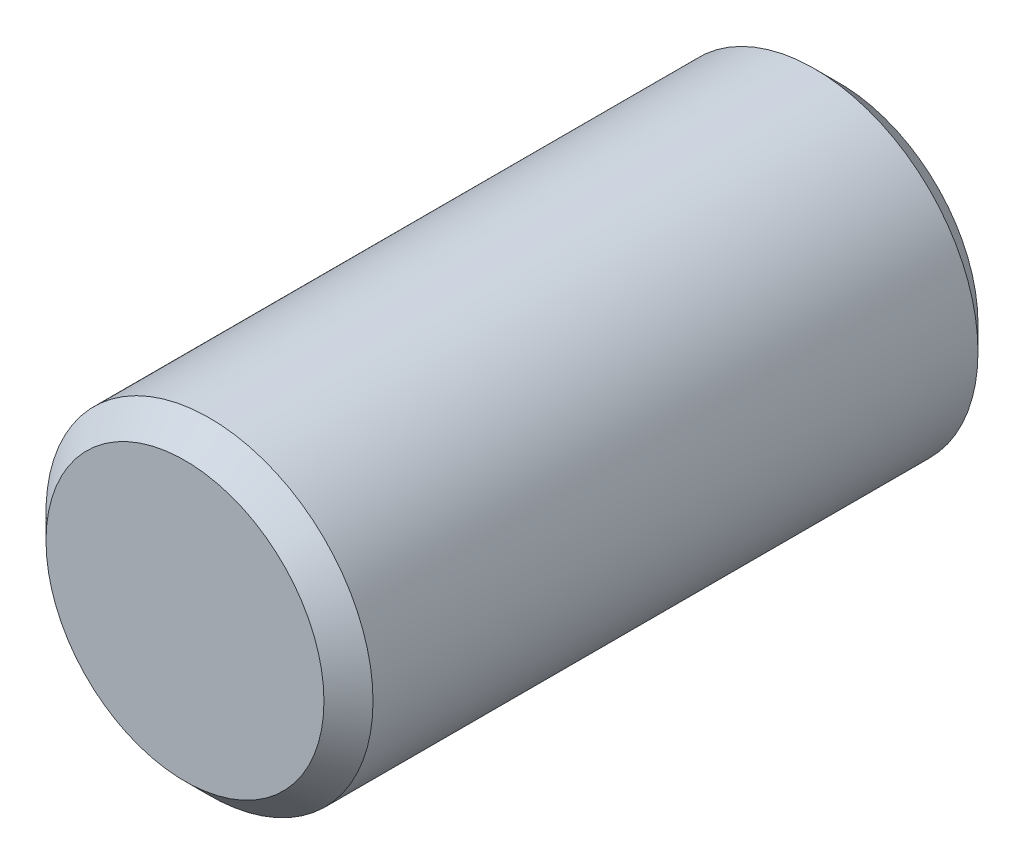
ISO-10303-21;
HEADER;
FILE_DESCRIPTION(('STEP AP214'),'2;1');
FILE_NAME('part.step','',(''),(''),'','','');
FILE_SCHEMA(('AUTOMOTIVE_DESIGN { 1 0 10303 214 1 1 1 1 }'));
ENDSEC;
DATA;
#1=APPLICATION_CONTEXT('core data for automotive mechanical design processes');
#2=APPLICATION_PROTOCOL_DEFINITION('international standard','automotive_design',2000,#1);
#3=PRODUCT_CONTEXT('',#1,'mechanical');
#4=PRODUCT('Part','Part','',(#3));
#5=PRODUCT_RELATED_PRODUCT_CATEGORY('part','',(#4));
#6=PRODUCT_DEFINITION_FORMATION('','',#4);
#7=PRODUCT_DEFINITION_CONTEXT('part definition',#1,'design');
#8=PRODUCT_DEFINITION('design','',#6,#7);
#9=PRODUCT_DEFINITION_SHAPE('','',#8);
#10=(LENGTH_UNIT() NAMED_UNIT(*) SI_UNIT(.MILLI.,.METRE.));
#11=(NAMED_UNIT(*) PLANE_ANGLE_UNIT() SI_UNIT($,.RADIAN.));
#12=(NAMED_UNIT(*) SI_UNIT($,.STERADIAN.) SOLID_ANGLE_UNIT());
#13=UNCERTAINTY_MEASURE_WITH_UNIT(LENGTH_MEASURE(1.E-05),#10,'distance_accuracy_value','');
#14=(GEOMETRIC_REPRESENTATION_CONTEXT(3) GLOBAL_UNCERTAINTY_ASSIGNED_CONTEXT((#13)) GLOBAL_UNIT_ASSIGNED_CONTEXT((#10,
#11,#12)) REPRESENTATION_CONTEXT('',''));
#15=CARTESIAN_POINT('',(0.,0.,0.));
#16=DIRECTION('',(0.,0.,1.));
#17=DIRECTION('',(1.,0.,0.));
#18=AXIS2_PLACEMENT_3D('',#15,#16,#17);
#19=CARTESIAN_POINT('',(0.,0.,-8.));
#20=DIRECTION('',(0.,0.,1.));
#21=DIRECTION('',(1.,0.,0.));
#22=AXIS2_PLACEMENT_3D('',#19,#20,#21);
#23=CYLINDRICAL_SURFACE('',#22,2.);
#24=CARTESIAN_POINT('',(0.,0.,-7.7));
#25=DIRECTION('',(0.,0.,1.));
#26=DIRECTION('',(1.,0.,0.));
#27=AXIS2_PLACEMENT_3D('',#24,#25,#26);
#28=CIRCLE('',#27,2.);
#29=CARTESIAN_POINT('',(2.,0.,-7.7));
#30=VERTEX_POINT('',#29);
#31=EDGE_CURVE('E147',#30,#30,#28,.T.);
#32=ORIENTED_EDGE('',*,*,#31,.T.);
#33=EDGE_LOOP('',(#32));
#34=FACE_BOUND('',#33,.T.);
#35=CARTESIAN_POINT('',(0.,0.,-0.299999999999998));
#36=DIRECTION('',(0.,0.,1.));
#37=DIRECTION('',(1.,0.,0.));
#38=AXIS2_PLACEMENT_3D('',#35,#36,#37);
#39=CIRCLE('',#38,2.);
#40=CARTESIAN_POINT('',(2.,0.,-0.299999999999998));
#41=VERTEX_POINT('',#40);
#42=EDGE_CURVE('E139',#41,#41,#39,.F.);
#43=ORIENTED_EDGE('',*,*,#42,.T.);
#44=EDGE_LOOP('',(#43));
#45=FACE_BOUND('',#44,.T.);
#46=ADVANCED_FACE('F37',(#34,#45),#23,.T.);
#47=CARTESIAN_POINT('',(0.,0.,-8.));
#48=DIRECTION('',(0.,0.,1.));
#49=DIRECTION('',(1.,0.,0.));
#50=AXIS2_PLACEMENT_3D('',#47,#48,#49);
#51=PLANE('',#50);
#52=CARTESIAN_POINT('',(0.,0.,-8.));
#53=DIRECTION('',(0.,0.,1.));
#54=DIRECTION('',(1.,0.,0.));
#55=AXIS2_PLACEMENT_3D('',#52,#53,#54);
#56=CIRCLE('',#55,1.7);
#57=CARTESIAN_POINT('',(1.7,0.,-8.));
#58=VERTEX_POINT('',#57);
#59=EDGE_CURVE('E45',#58,#58,#56,.F.);
#60=ORIENTED_EDGE('',*,*,#59,.T.);
#61=EDGE_LOOP('',(#60));
#62=FACE_BOUND('',#61,.T.);
#63=DIRECTION('',(0.5,0.866025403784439,0.));
#64=VECTOR('',#63,1.);
#65=CARTESIAN_POINT('',(-1.15470053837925,0.,-8.));
#66=LINE('',#65,#64);
#67=CARTESIAN_POINT('',(-1.15470053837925,0.,-8.));
#68=VERTEX_POINT('',#67);
#69=CARTESIAN_POINT('',(-0.577350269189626,1.,-8.));
#70=VERTEX_POINT('',#69);
#71=EDGE_CURVE('E126',#68,#70,#66,.T.);
#72=ORIENTED_EDGE('',*,*,#71,.F.);
#73=DIRECTION('',(-0.5,0.866025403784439,0.));
#74=VECTOR('',#73,1.);
#75=CARTESIAN_POINT('',(-0.577350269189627,-1.,-8.));
#76=LINE('',#75,#74);
#77=CARTESIAN_POINT('',(-0.577350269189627,-1.,-8.));
#78=VERTEX_POINT('',#77);
#79=EDGE_CURVE('E52',#78,#68,#76,.T.);
#80=ORIENTED_EDGE('',*,*,#79,.F.);
#81=DIRECTION('',(-1.,0.,0.));
#82=VECTOR('',#81,1.);
#83=CARTESIAN_POINT('',(0.577350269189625,-1.,-8.));
#84=LINE('',#83,#82);
#85=CARTESIAN_POINT('',(0.577350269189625,-1.,-8.));
#86=VERTEX_POINT('',#85);
#87=EDGE_CURVE('E135',#86,#78,#84,.T.);
#88=ORIENTED_EDGE('',*,*,#87,.F.);
#89=DIRECTION('',(-0.5,-0.866025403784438,0.));
#90=VECTOR('',#89,1.);
#91=CARTESIAN_POINT('',(1.15470053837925,0.,-8.));
#92=LINE('',#91,#90);
#93=CARTESIAN_POINT('',(1.15470053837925,0.,-8.));
#94=VERTEX_POINT('',#93);
#95=EDGE_CURVE('E133',#94,#86,#92,.T.);
#96=ORIENTED_EDGE('',*,*,#95,.F.);
#97=DIRECTION('',(0.5,-0.866025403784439,0.));
#98=VECTOR('',#97,1.);
#99=CARTESIAN_POINT('',(0.577350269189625,1.,-8.));
#100=LINE('',#99,#98);
#101=CARTESIAN_POINT('',(0.577350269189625,1.,-8.));
#102=VERTEX_POINT('',#101);
#103=EDGE_CURVE('E100',#102,#94,#100,.T.);
#104=ORIENTED_EDGE('',*,*,#103,.F.);
#105=DIRECTION('',(1.,0.,0.));
#106=VECTOR('',#105,1.);
#107=CARTESIAN_POINT('',(-0.577350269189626,1.,-8.));
#108=LINE('',#107,#106);
#109=EDGE_CURVE('E129',#70,#102,#108,.T.);
#110=ORIENTED_EDGE('',*,*,#109,.F.);
#111=EDGE_LOOP('',(#72,#80,#88,#96,#104,#110));
#112=FACE_BOUND('',#111,.T.);
#113=ADVANCED_FACE('F152',(#62,#112),#51,.F.);
#114=CARTESIAN_POINT('',(0.,0.,0.));
#115=DIRECTION('',(0.,0.,1.));
#116=DIRECTION('',(1.,0.,0.));
#117=AXIS2_PLACEMENT_3D('',#114,#115,#116);
#118=PLANE('',#117);
#119=CARTESIAN_POINT('',(0.,0.,0.));
#120=DIRECTION('',(0.,0.,1.));
#121=DIRECTION('',(1.,0.,0.));
#122=AXIS2_PLACEMENT_3D('',#119,#120,#121);
#123=CIRCLE('',#122,1.7);
#124=CARTESIAN_POINT('',(1.7,0.,0.));
#125=VERTEX_POINT('',#124);
#126=EDGE_CURVE('E11',#125,#125,#123,.T.);
#127=ORIENTED_EDGE('',*,*,#126,.T.);
#128=EDGE_LOOP('',(#127));
#129=FACE_BOUND('',#128,.T.);
#130=ADVANCED_FACE('F169',(#129),#118,.T.);
#131=CARTESIAN_POINT('',(-0.577350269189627,-1.,-6.));
#132=DIRECTION('',(-0.866025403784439,-0.5,0.));
#133=DIRECTION('',(0.5,-0.866025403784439,0.));
#134=AXIS2_PLACEMENT_3D('',#131,#132,#133);
#135=PLANE('',#134);
#136=ORIENTED_EDGE('',*,*,#79,.T.);
#137=DIRECTION('',(0.,0.,-1.));
#138=VECTOR('',#137,1.);
#139=CARTESIAN_POINT('',(-1.15470053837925,0.,-6.));
#140=LINE('',#139,#138);
#141=CARTESIAN_POINT('',(-1.15470053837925,0.,-6.));
#142=VERTEX_POINT('',#141);
#143=EDGE_CURVE('E82',#142,#68,#140,.T.);
#144=ORIENTED_EDGE('',*,*,#143,.F.);
#145=DIRECTION('',(-0.5,0.866025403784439,0.));
#146=VECTOR('',#145,1.);
#147=CARTESIAN_POINT('',(-0.577350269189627,-1.,-6.));
#148=LINE('',#147,#146);
#149=CARTESIAN_POINT('',(-0.577350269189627,-1.,-6.));
#150=VERTEX_POINT('',#149);
#151=EDGE_CURVE('E137',#150,#142,#148,.T.);
#152=ORIENTED_EDGE('',*,*,#151,.F.);
#153=DIRECTION('',(0.,0.,-1.));
#154=VECTOR('',#153,1.);
#155=CARTESIAN_POINT('',(-0.577350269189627,-1.,-6.));
#156=LINE('',#155,#154);
#157=EDGE_CURVE('E60',#150,#78,#156,.T.);
#158=ORIENTED_EDGE('',*,*,#157,.T.);
#159=EDGE_LOOP('',(#136,#144,#152,#158));
#160=FACE_BOUND('',#159,.T.);
#161=ADVANCED_FACE('F171',(#160),#135,.F.);
#162=CARTESIAN_POINT('',(0.577350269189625,-1.,-6.));
#163=DIRECTION('',(0.,-1.,0.));
#164=DIRECTION('',(0.,0.,-1.));
#165=AXIS2_PLACEMENT_3D('',#162,#163,#164);
#166=PLANE('',#165);
#167=ORIENTED_EDGE('',*,*,#87,.T.);
#168=ORIENTED_EDGE('',*,*,#157,.F.);
#169=DIRECTION('',(-1.,0.,0.));
#170=VECTOR('',#169,1.);
#171=CARTESIAN_POINT('',(0.577350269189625,-1.,-6.));
#172=LINE('',#171,#170);
#173=CARTESIAN_POINT('',(0.577350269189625,-1.,-6.));
#174=VERTEX_POINT('',#173);
#175=EDGE_CURVE('E112',#174,#150,#172,.T.);
#176=ORIENTED_EDGE('',*,*,#175,.F.);
#177=DIRECTION('',(0.,0.,-1.));
#178=VECTOR('',#177,1.);
#179=CARTESIAN_POINT('',(0.577350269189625,-1.,-6.));
#180=LINE('',#179,#178);
#181=EDGE_CURVE('E104',#174,#86,#180,.T.);
#182=ORIENTED_EDGE('',*,*,#181,.T.);
#183=EDGE_LOOP('',(#167,#168,#176,#182));
#184=FACE_BOUND('',#183,.T.);
#185=ADVANCED_FACE('F177',(#184),#166,.F.);
#186=CARTESIAN_POINT('',(1.15470053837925,0.,-6.));
#187=DIRECTION('',(0.866025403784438,-0.5,0.));
#188=DIRECTION('',(0.5,0.866025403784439,0.));
#189=AXIS2_PLACEMENT_3D('',#186,#187,#188);
#190=PLANE('',#189);
#191=ORIENTED_EDGE('',*,*,#95,.T.);
#192=ORIENTED_EDGE('',*,*,#181,.F.);
#193=DIRECTION('',(-0.5,-0.866025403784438,0.));
#194=VECTOR('',#193,1.);
#195=CARTESIAN_POINT('',(1.15470053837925,0.,-6.));
#196=LINE('',#195,#194);
#197=CARTESIAN_POINT('',(1.15470053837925,0.,-6.));
#198=VERTEX_POINT('',#197);
#199=EDGE_CURVE('E108',#198,#174,#196,.T.);
#200=ORIENTED_EDGE('',*,*,#199,.F.);
#201=DIRECTION('',(0.,0.,-1.));
#202=VECTOR('',#201,1.);
#203=CARTESIAN_POINT('',(1.15470053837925,0.,-6.));
#204=LINE('',#203,#202);
#205=EDGE_CURVE('E93',#198,#94,#204,.T.);
#206=ORIENTED_EDGE('',*,*,#205,.T.);
#207=EDGE_LOOP('',(#191,#192,#200,#206));
#208=FACE_BOUND('',#207,.T.);
#209=ADVANCED_FACE('F109',(#208),#190,.F.);
#210=CARTESIAN_POINT('',(0.577350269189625,1.,-6.));
#211=DIRECTION('',(0.866025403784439,0.5,0.));
#212=DIRECTION('',(-0.5,0.866025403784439,0.));
#213=AXIS2_PLACEMENT_3D('',#210,#211,#212);
#214=PLANE('',#213);
#215=ORIENTED_EDGE('',*,*,#103,.T.);
#216=ORIENTED_EDGE('',*,*,#205,.F.);
#217=DIRECTION('',(0.5,-0.866025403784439,0.));
#218=VECTOR('',#217,1.);
#219=CARTESIAN_POINT('',(0.577350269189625,1.,-6.));
#220=LINE('',#219,#218);
#221=CARTESIAN_POINT('',(0.577350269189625,1.,-6.));
#222=VERTEX_POINT('',#221);
#223=EDGE_CURVE('E97',#222,#198,#220,.T.);
#224=ORIENTED_EDGE('',*,*,#223,.F.);
#225=DIRECTION('',(0.,0.,-1.));
#226=VECTOR('',#225,1.);
#227=CARTESIAN_POINT('',(0.577350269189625,1.,-6.));
#228=LINE('',#227,#226);
#229=EDGE_CURVE('E105',#222,#102,#228,.T.);
#230=ORIENTED_EDGE('',*,*,#229,.T.);
#231=EDGE_LOOP('',(#215,#216,#224,#230));
#232=FACE_BOUND('',#231,.T.);
#233=ADVANCED_FACE('F95',(#232),#214,.F.);
#234=CARTESIAN_POINT('',(-0.577350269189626,1.,-6.));
#235=DIRECTION('',(0.,1.,0.));
#236=DIRECTION('',(0.,0.,1.));
#237=AXIS2_PLACEMENT_3D('',#234,#235,#236);
#238=PLANE('',#237);
#239=ORIENTED_EDGE('',*,*,#109,.T.);
#240=ORIENTED_EDGE('',*,*,#229,.F.);
#241=DIRECTION('',(1.,0.,0.));
#242=VECTOR('',#241,1.);
#243=CARTESIAN_POINT('',(-0.577350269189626,1.,-6.));
#244=LINE('',#243,#242);
#245=CARTESIAN_POINT('',(-0.577350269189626,1.,-6.));
#246=VERTEX_POINT('',#245);
#247=EDGE_CURVE('E118',#246,#222,#244,.T.);
#248=ORIENTED_EDGE('',*,*,#247,.F.);
#249=DIRECTION('',(0.,0.,-1.));
#250=VECTOR('',#249,1.);
#251=CARTESIAN_POINT('',(-0.577350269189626,1.,-6.));
#252=LINE('',#251,#250);
#253=EDGE_CURVE('E142',#246,#70,#252,.T.);
#254=ORIENTED_EDGE('',*,*,#253,.T.);
#255=EDGE_LOOP('',(#239,#240,#248,#254));
#256=FACE_BOUND('',#255,.T.);
#257=ADVANCED_FACE('F184',(#256),#238,.F.);
#258=CARTESIAN_POINT('',(-1.15470053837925,0.,-6.));
#259=DIRECTION('',(-0.866025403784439,0.5,0.));
#260=DIRECTION('',(-0.5,-0.866025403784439,0.));
#261=AXIS2_PLACEMENT_3D('',#258,#259,#260);
#262=PLANE('',#261);
#263=ORIENTED_EDGE('',*,*,#71,.T.);
#264=ORIENTED_EDGE('',*,*,#253,.F.);
#265=DIRECTION('',(0.5,0.866025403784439,0.));
#266=VECTOR('',#265,1.);
#267=CARTESIAN_POINT('',(-1.15470053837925,0.,-6.));
#268=LINE('',#267,#266);
#269=EDGE_CURVE('E120',#142,#246,#268,.T.);
#270=ORIENTED_EDGE('',*,*,#269,.F.);
#271=ORIENTED_EDGE('',*,*,#143,.T.);
#272=EDGE_LOOP('',(#263,#264,#270,#271));
#273=FACE_BOUND('',#272,.T.);
#274=ADVANCED_FACE('F181',(#273),#262,.F.);
#275=CARTESIAN_POINT('',(0.,-2.,-6.));
#276=DIRECTION('',(0.,0.,1.));
#277=DIRECTION('',(1.,0.,0.));
#278=AXIS2_PLACEMENT_3D('',#275,#276,#277);
#279=PLANE('',#278);
#280=ORIENTED_EDGE('',*,*,#151,.T.);
#281=ORIENTED_EDGE('',*,*,#269,.T.);
#282=ORIENTED_EDGE('',*,*,#247,.T.);
#283=ORIENTED_EDGE('',*,*,#223,.T.);
#284=ORIENTED_EDGE('',*,*,#199,.T.);
#285=ORIENTED_EDGE('',*,*,#175,.T.);
#286=EDGE_LOOP('',(#280,#281,#282,#283,#284,#285));
#287=FACE_BOUND('',#286,.T.);
#288=ADVANCED_FACE('F115',(#287),#279,.F.);
#289=CARTESIAN_POINT('',(0.,0.,-7.7));
#290=DIRECTION('',(0.,0.,1.));
#291=DIRECTION('',(1.,0.,0.));
#292=AXIS2_PLACEMENT_3D('',#289,#290,#291);
#293=CONICAL_SURFACE('',#292,2.,0.78539816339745);
#294=CARTESIAN_POINT('',(1.7,0.,-8.));
#295=CARTESIAN_POINT('',(1.703125,0.,-7.996875));
#296=CARTESIAN_POINT('',(1.70625,0.,-7.99375));
#297=CARTESIAN_POINT('',(1.7125,0.,-7.9875));
#298=CARTESIAN_POINT('',(1.715625,0.,-7.984375));
#299=CARTESIAN_POINT('',(1.721875,0.,-7.978125));
#300=CARTESIAN_POINT('',(1.725,0.,-7.975));
#301=CARTESIAN_POINT('',(1.73125,0.,-7.96875));
#302=CARTESIAN_POINT('',(1.734375,0.,-7.965625));
#303=CARTESIAN_POINT('',(1.740625,0.,-7.959375));
#304=CARTESIAN_POINT('',(1.74375,0.,-7.95625));
#305=CARTESIAN_POINT('',(1.75,0.,-7.95));
#306=CARTESIAN_POINT('',(1.753125,0.,-7.946875));
#307=CARTESIAN_POINT('',(1.759375,0.,-7.940625));
#308=CARTESIAN_POINT('',(1.7625,0.,-7.9375));
#309=CARTESIAN_POINT('',(1.76875,0.,-7.93125));
#310=CARTESIAN_POINT('',(1.771875,0.,-7.928125));
#311=CARTESIAN_POINT('',(1.778125,0.,-7.921875));
#312=CARTESIAN_POINT('',(1.78125,0.,-7.91875));
#313=CARTESIAN_POINT('',(1.7875,0.,-7.9125));
#314=CARTESIAN_POINT('',(1.790625,0.,-7.909375));
#315=CARTESIAN_POINT('',(1.796875,0.,-7.903125));
#316=CARTESIAN_POINT('',(1.8,0.,-7.9));
#317=CARTESIAN_POINT('',(1.80625,0.,-7.89375));
#318=CARTESIAN_POINT('',(1.809375,0.,-7.890625));
#319=CARTESIAN_POINT('',(1.815625,0.,-7.884375));
#320=CARTESIAN_POINT('',(1.81875,0.,-7.88125));
#321=CARTESIAN_POINT('',(1.825,0.,-7.875));
#322=CARTESIAN_POINT('',(1.828125,0.,-7.871875));
#323=CARTESIAN_POINT('',(1.834375,0.,-7.865625));
#324=CARTESIAN_POINT('',(1.8375,0.,-7.8625));
#325=CARTESIAN_POINT('',(1.84375,0.,-7.85625));
#326=CARTESIAN_POINT('',(1.846875,0.,-7.853125));
#327=CARTESIAN_POINT('',(1.853125,0.,-7.846875));
#328=CARTESIAN_POINT('',(1.85625,0.,-7.84375));
#329=CARTESIAN_POINT('',(1.8625,0.,-7.8375));
#330=CARTESIAN_POINT('',(1.865625,0.,-7.834375));
#331=CARTESIAN_POINT('',(1.871875,0.,-7.828125));
#332=CARTESIAN_POINT('',(1.875,0.,-7.825));
#333=CARTESIAN_POINT('',(1.88125,0.,-7.81875));
#334=CARTESIAN_POINT('',(1.884375,0.,-7.815625));
#335=CARTESIAN_POINT('',(1.890625,0.,-7.809375));
#336=CARTESIAN_POINT('',(1.89375,0.,-7.80625));
#337=CARTESIAN_POINT('',(1.9,0.,-7.8));
#338=CARTESIAN_POINT('',(1.903125,0.,-7.796875));
#339=CARTESIAN_POINT('',(1.909375,0.,-7.790625));
#340=CARTESIAN_POINT('',(1.9125,0.,-7.7875));
#341=CARTESIAN_POINT('',(1.91875,0.,-7.78125));
#342=CARTESIAN_POINT('',(1.921875,0.,-7.778125));
#343=CARTESIAN_POINT('',(1.928125,0.,-7.771875));
#344=CARTESIAN_POINT('',(1.93125,0.,-7.76875));
#345=CARTESIAN_POINT('',(1.9375,0.,-7.7625));
#346=CARTESIAN_POINT('',(1.940625,0.,-7.759375));
#347=CARTESIAN_POINT('',(1.946875,0.,-7.753125));
#348=CARTESIAN_POINT('',(1.95,0.,-7.75));
#349=CARTESIAN_POINT('',(1.95625,0.,-7.74375));
#350=CARTESIAN_POINT('',(1.959375,0.,-7.740625));
#351=CARTESIAN_POINT('',(1.965625,0.,-7.734375));
#352=CARTESIAN_POINT('',(1.96875,0.,-7.73125));
#353=CARTESIAN_POINT('',(1.975,0.,-7.725));
#354=CARTESIAN_POINT('',(1.978125,0.,-7.721875));
#355=CARTESIAN_POINT('',(1.984375,0.,-7.715625));
#356=CARTESIAN_POINT('',(1.9875,0.,-7.7125));
#357=CARTESIAN_POINT('',(1.99375,0.,-7.70625));
#358=CARTESIAN_POINT('',(1.996875,0.,-7.703125));
#359=CARTESIAN_POINT('',(2.,0.,-7.7));
#360=B_SPLINE_CURVE_WITH_KNOTS('',3,(#294,#295,#296,#297,#298,#299,#300,#301,#302,#303,#304,
#305,#306,#307,#308,#309,#310,#311,#312,#313,#314,#315,#316,#317,#318,#319,#320,#321,#322,#323,
#324,#325,#326,#327,#328,#329,#330,#331,#332,#333,#334,#335,#336,#337,#338,#339,#340,#341,#342,
#343,#344,#345,#346,#347,#348,#349,#350,#351,#352,#353,#354,#355,#356,#357,#358,#359),
.UNSPECIFIED.,.F.,.F.,(4,2,2,2,2,2,2,2,2,2,2,2,2,2,2,2,2,2,2,2,2,2,2,2,2,2,2,2,2,2,2,2,4),(0.,
0.0132582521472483,0.0265165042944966,0.0397747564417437,0.053033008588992,0.0662912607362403,
0.0795495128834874,0.0928077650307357,0.106066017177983,0.119324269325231,0.132582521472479,
0.145840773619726,0.159099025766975,0.172357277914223,0.18561553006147,0.198873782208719,
0.212132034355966,0.225390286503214,0.238648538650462,0.251906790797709,0.265165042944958,
0.278423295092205,0.291681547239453,0.304939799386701,0.318198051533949,0.331456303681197,
0.344714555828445,0.357972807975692,0.37123106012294,0.384489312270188,0.397747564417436,
0.411005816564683,0.424264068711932),.UNSPECIFIED.);
#361=EDGE_CURVE('BSEAM155',#58,#30,#360,.T.);
#362=ORIENTED_EDGE('',*,*,#59,.F.);
#363=ORIENTED_EDGE('',*,*,#31,.F.);
#364=ORIENTED_EDGE('',*,*,#361,.T.);
#365=ORIENTED_EDGE('',*,*,#361,.F.);
#366=EDGE_LOOP('',(#362,#364,#363,#365));
#367=FACE_BOUND('',#366,.T.);
#368=ADVANCED_FACE('F155',(#367),#293,.T.);
#369=CARTESIAN_POINT('',(0.,0.,0.));
#370=DIRECTION('',(0.,0.,-1.));
#371=DIRECTION('',(-1.,0.,0.));
#372=AXIS2_PLACEMENT_3D('',#369,#370,#371);
#373=CONICAL_SURFACE('',#372,1.7,0.78539816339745);
#374=ORIENTED_EDGE('',*,*,#42,.F.);
#375=EDGE_LOOP('',(#374));
#376=FACE_BOUND('',#375,.T.);
#377=ORIENTED_EDGE('',*,*,#126,.F.);
#378=EDGE_LOOP('',(#377));
#379=FACE_BOUND('',#378,.T.);
#380=ADVANCED_FACE('F39',(#376,#379),#373,.T.);
#381=CLOSED_SHELL('',(#46,#113,#130,#161,#185,#209,#233,#257,#274,#288,#368,#380));
#382=MANIFOLD_SOLID_BREP('B2',#381);
#383=ADVANCED_BREP_SHAPE_REPRESENTATION('',(#18,#382),#14);
#384=SHAPE_DEFINITION_REPRESENTATION(#9,#383);
ENDSEC;
END-ISO-10303-21;
